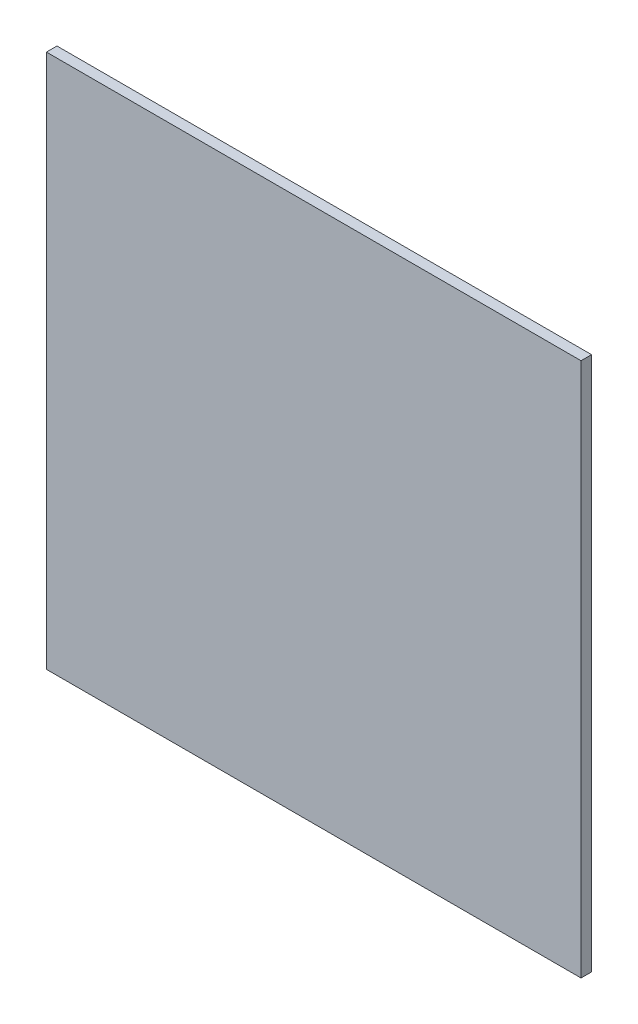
ISO-10303-21;
HEADER;
FILE_DESCRIPTION(('STEP AP214'),'2;1');
FILE_NAME('part.step','',(''),(''),'','','');
FILE_SCHEMA(('AUTOMOTIVE_DESIGN { 1 0 10303 214 1 1 1 1 }'));
ENDSEC;
DATA;
#1=APPLICATION_CONTEXT('core data for automotive mechanical design processes');
#2=APPLICATION_PROTOCOL_DEFINITION('international standard','automotive_design',2000,#1);
#3=PRODUCT_CONTEXT('',#1,'mechanical');
#4=PRODUCT('Part','Part','',(#3));
#5=PRODUCT_RELATED_PRODUCT_CATEGORY('part','',(#4));
#6=PRODUCT_DEFINITION_FORMATION('','',#4);
#7=PRODUCT_DEFINITION_CONTEXT('part definition',#1,'design');
#8=PRODUCT_DEFINITION('design','',#6,#7);
#9=PRODUCT_DEFINITION_SHAPE('','',#8);
#10=(LENGTH_UNIT() NAMED_UNIT(*) SI_UNIT(.MILLI.,.METRE.));
#11=(NAMED_UNIT(*) PLANE_ANGLE_UNIT() SI_UNIT($,.RADIAN.));
#12=(NAMED_UNIT(*) SI_UNIT($,.STERADIAN.) SOLID_ANGLE_UNIT());
#13=UNCERTAINTY_MEASURE_WITH_UNIT(LENGTH_MEASURE(1.E-05),#10,'distance_accuracy_value','');
#14=(GEOMETRIC_REPRESENTATION_CONTEXT(3) GLOBAL_UNCERTAINTY_ASSIGNED_CONTEXT((#13)) GLOBAL_UNIT_ASSIGNED_CONTEXT((#10,
#11,#12)) REPRESENTATION_CONTEXT('',''));
#15=CARTESIAN_POINT('',(0.,0.,0.));
#16=DIRECTION('',(0.,0.,1.));
#17=DIRECTION('',(1.,0.,0.));
#18=AXIS2_PLACEMENT_3D('',#15,#16,#17);
#19=CARTESIAN_POINT('',(-0.25399746,0.254,0.));
#20=DIRECTION('',(0.,1.,0.));
#21=DIRECTION('',(1.,0.,0.));
#22=AXIS2_PLACEMENT_3D('',#19,#20,#21);
#23=PLANE('',#22);
#24=DIRECTION('',(0.,0.,1.));
#25=VECTOR('',#24,1.);
#26=CARTESIAN_POINT('',(-0.25399746,0.254,0.));
#27=LINE('',#26,#25);
#28=CARTESIAN_POINT('',(-0.25399746,0.254,0.));
#29=VERTEX_POINT('',#28);
#30=CARTESIAN_POINT('',(-0.25399746,0.254,0.00999998));
#31=VERTEX_POINT('',#30);
#32=EDGE_CURVE('E11',#29,#31,#27,.T.);
#33=ORIENTED_EDGE('',*,*,#32,.T.);
#34=DIRECTION('',(1.,0.,0.));
#35=VECTOR('',#34,1.);
#36=CARTESIAN_POINT('',(-0.25399746,0.254,0.00999998));
#37=LINE('',#36,#35);
#38=CARTESIAN_POINT('',(0.254,0.254,0.00999998));
#39=VERTEX_POINT('',#38);
#40=EDGE_CURVE('E25',#31,#39,#37,.T.);
#41=ORIENTED_EDGE('',*,*,#40,.T.);
#42=DIRECTION('',(0.,0.,1.));
#43=VECTOR('',#42,1.);
#44=CARTESIAN_POINT('',(0.254,0.254,0.));
#45=LINE('',#44,#43);
#46=CARTESIAN_POINT('',(0.254,0.254,0.));
#47=VERTEX_POINT('',#46);
#48=EDGE_CURVE('E73',#47,#39,#45,.T.);
#49=ORIENTED_EDGE('',*,*,#48,.F.);
#50=DIRECTION('',(1.,0.,0.));
#51=VECTOR('',#50,1.);
#52=CARTESIAN_POINT('',(-0.25399746,0.254,0.));
#53=LINE('',#52,#51);
#54=EDGE_CURVE('E99',#29,#47,#53,.T.);
#55=ORIENTED_EDGE('',*,*,#54,.F.);
#56=EDGE_LOOP('',(#33,#41,#49,#55));
#57=FACE_BOUND('',#56,.T.);
#58=ADVANCED_FACE('F17',(#57),#23,.T.);
#59=CARTESIAN_POINT('',(1.270000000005E-06,0.,0.));
#60=DIRECTION('',(0.,0.,-1.));
#61=DIRECTION('',(-1.,0.,0.));
#62=AXIS2_PLACEMENT_3D('',#59,#60,#61);
#63=PLANE('',#62);
#64=ORIENTED_EDGE('',*,*,#54,.T.);
#65=DIRECTION('',(0.,-1.,0.));
#66=VECTOR('',#65,1.);
#67=CARTESIAN_POINT('',(0.254,0.254,0.));
#68=LINE('',#67,#66);
#69=CARTESIAN_POINT('',(0.254,-0.254,0.));
#70=VERTEX_POINT('',#69);
#71=EDGE_CURVE('E95',#47,#70,#68,.T.);
#72=ORIENTED_EDGE('',*,*,#71,.T.);
#73=DIRECTION('',(-1.,0.,0.));
#74=VECTOR('',#73,1.);
#75=CARTESIAN_POINT('',(0.254,-0.254,0.));
#76=LINE('',#75,#74);
#77=CARTESIAN_POINT('',(-0.25399746,-0.254,0.));
#78=VERTEX_POINT('',#77);
#79=EDGE_CURVE('E68',#70,#78,#76,.T.);
#80=ORIENTED_EDGE('',*,*,#79,.T.);
#81=DIRECTION('',(0.,1.,0.));
#82=VECTOR('',#81,1.);
#83=CARTESIAN_POINT('',(-0.25399746,-0.254,0.));
#84=LINE('',#83,#82);
#85=EDGE_CURVE('E87',#78,#29,#84,.T.);
#86=ORIENTED_EDGE('',*,*,#85,.T.);
#87=EDGE_LOOP('',(#64,#72,#80,#86));
#88=FACE_BOUND('',#87,.T.);
#89=ADVANCED_FACE('F112',(#88),#63,.T.);
#90=CARTESIAN_POINT('',(-0.25399746,-0.254,0.));
#91=DIRECTION('',(-1.,0.,0.));
#92=DIRECTION('',(0.,1.,0.));
#93=AXIS2_PLACEMENT_3D('',#90,#91,#92);
#94=PLANE('',#93);
#95=DIRECTION('',(0.,0.,1.));
#96=VECTOR('',#95,1.);
#97=CARTESIAN_POINT('',(-0.25399746,-0.254,0.));
#98=LINE('',#97,#96);
#99=CARTESIAN_POINT('',(-0.25399746,-0.254,0.00999998));
#100=VERTEX_POINT('',#99);
#101=EDGE_CURVE('E83',#78,#100,#98,.T.);
#102=ORIENTED_EDGE('',*,*,#101,.T.);
#103=DIRECTION('',(0.,1.,0.));
#104=VECTOR('',#103,1.);
#105=CARTESIAN_POINT('',(-0.25399746,-0.254,0.00999998));
#106=LINE('',#105,#104);
#107=EDGE_CURVE('E60',#100,#31,#106,.T.);
#108=ORIENTED_EDGE('',*,*,#107,.T.);
#109=ORIENTED_EDGE('',*,*,#32,.F.);
#110=ORIENTED_EDGE('',*,*,#85,.F.);
#111=EDGE_LOOP('',(#102,#108,#109,#110));
#112=FACE_BOUND('',#111,.T.);
#113=ADVANCED_FACE('F119',(#112),#94,.T.);
#114=CARTESIAN_POINT('',(1.270000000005E-06,0.,0.00999998));
#115=DIRECTION('',(0.,0.,-1.));
#116=DIRECTION('',(-1.,0.,0.));
#117=AXIS2_PLACEMENT_3D('',#114,#115,#116);
#118=PLANE('',#117);
#119=ORIENTED_EDGE('',*,*,#107,.F.);
#120=DIRECTION('',(-1.,0.,0.));
#121=VECTOR('',#120,1.);
#122=CARTESIAN_POINT('',(0.254,-0.254,0.00999998));
#123=LINE('',#122,#121);
#124=CARTESIAN_POINT('',(0.254,-0.254,0.00999998));
#125=VERTEX_POINT('',#124);
#126=EDGE_CURVE('E54',#125,#100,#123,.T.);
#127=ORIENTED_EDGE('',*,*,#126,.F.);
#128=DIRECTION('',(0.,-1.,0.));
#129=VECTOR('',#128,1.);
#130=CARTESIAN_POINT('',(0.254,0.254,0.00999998));
#131=LINE('',#130,#129);
#132=EDGE_CURVE('E58',#39,#125,#131,.T.);
#133=ORIENTED_EDGE('',*,*,#132,.F.);
#134=ORIENTED_EDGE('',*,*,#40,.F.);
#135=EDGE_LOOP('',(#119,#127,#133,#134));
#136=FACE_BOUND('',#135,.T.);
#137=ADVANCED_FACE('F56',(#136),#118,.F.);
#138=CARTESIAN_POINT('',(0.254,0.254,0.));
#139=DIRECTION('',(1.,0.,0.));
#140=DIRECTION('',(0.,-1.,0.));
#141=AXIS2_PLACEMENT_3D('',#138,#139,#140);
#142=PLANE('',#141);
#143=ORIENTED_EDGE('',*,*,#48,.T.);
#144=ORIENTED_EDGE('',*,*,#132,.T.);
#145=DIRECTION('',(0.,0.,1.));
#146=VECTOR('',#145,1.);
#147=CARTESIAN_POINT('',(0.254,-0.254,0.));
#148=LINE('',#147,#146);
#149=EDGE_CURVE('E66',#70,#125,#148,.T.);
#150=ORIENTED_EDGE('',*,*,#149,.F.);
#151=ORIENTED_EDGE('',*,*,#71,.F.);
#152=EDGE_LOOP('',(#143,#144,#150,#151));
#153=FACE_BOUND('',#152,.T.);
#154=ADVANCED_FACE('F72',(#153),#142,.T.);
#155=CARTESIAN_POINT('',(0.254,-0.254,0.));
#156=DIRECTION('',(0.,-1.,0.));
#157=DIRECTION('',(-1.,0.,0.));
#158=AXIS2_PLACEMENT_3D('',#155,#156,#157);
#159=PLANE('',#158);
#160=ORIENTED_EDGE('',*,*,#149,.T.);
#161=ORIENTED_EDGE('',*,*,#126,.T.);
#162=ORIENTED_EDGE('',*,*,#101,.F.);
#163=ORIENTED_EDGE('',*,*,#79,.F.);
#164=EDGE_LOOP('',(#160,#161,#162,#163));
#165=FACE_BOUND('',#164,.T.);
#166=ADVANCED_FACE('F67',(#165),#159,.T.);
#167=CLOSED_SHELL('',(#58,#89,#113,#137,#154,#166));
#168=MANIFOLD_SOLID_BREP('B1',#167);
#169=ADVANCED_BREP_SHAPE_REPRESENTATION('',(#18,#168),#14);
#170=SHAPE_DEFINITION_REPRESENTATION(#9,#169);
ENDSEC;
END-ISO-10303-21;
